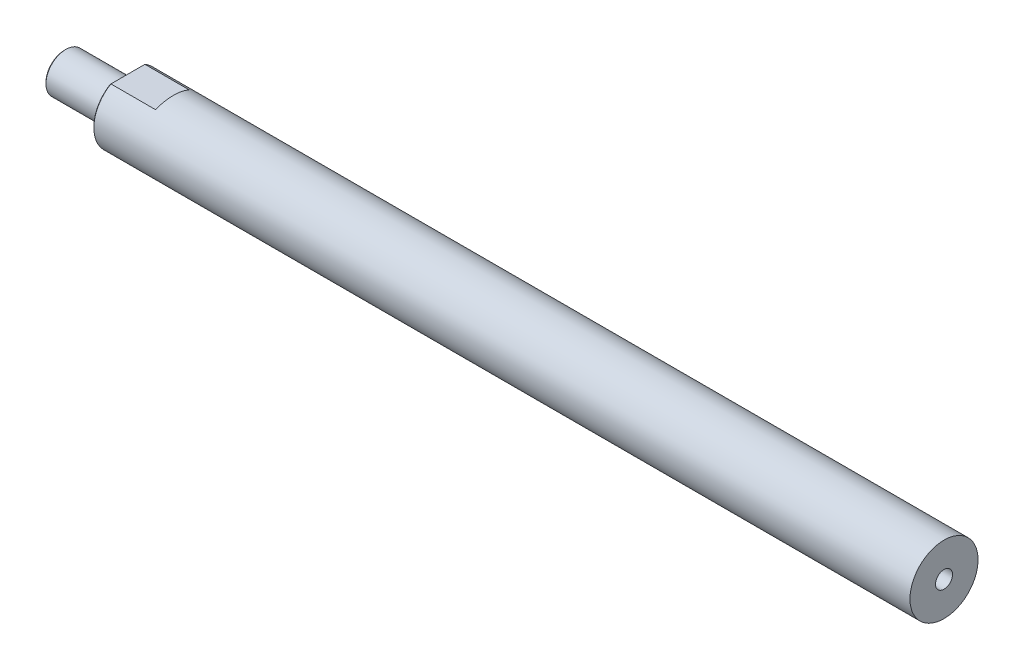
ISO-10303-21;
HEADER;
FILE_DESCRIPTION(('STEP AP214'),'2;1');
FILE_NAME('part.step','',(''),(''),'','','');
FILE_SCHEMA(('AUTOMOTIVE_DESIGN { 1 0 10303 214 1 1 1 1 }'));
ENDSEC;
DATA;
#1=APPLICATION_CONTEXT('core data for automotive mechanical design processes');
#2=APPLICATION_PROTOCOL_DEFINITION('international standard','automotive_design',2000,#1);
#3=PRODUCT_CONTEXT('',#1,'mechanical');
#4=PRODUCT('Part','Part','',(#3));
#5=PRODUCT_RELATED_PRODUCT_CATEGORY('part','',(#4));
#6=PRODUCT_DEFINITION_FORMATION('','',#4);
#7=PRODUCT_DEFINITION_CONTEXT('part definition',#1,'design');
#8=PRODUCT_DEFINITION('design','',#6,#7);
#9=PRODUCT_DEFINITION_SHAPE('','',#8);
#10=(LENGTH_UNIT() NAMED_UNIT(*) SI_UNIT(.MILLI.,.METRE.));
#11=(NAMED_UNIT(*) PLANE_ANGLE_UNIT() SI_UNIT($,.RADIAN.));
#12=(NAMED_UNIT(*) SI_UNIT($,.STERADIAN.) SOLID_ANGLE_UNIT());
#13=UNCERTAINTY_MEASURE_WITH_UNIT(LENGTH_MEASURE(1.E-05),#10,'distance_accuracy_value','');
#14=(GEOMETRIC_REPRESENTATION_CONTEXT(3) GLOBAL_UNCERTAINTY_ASSIGNED_CONTEXT((#13)) GLOBAL_UNIT_ASSIGNED_CONTEXT((#10,
#11,#12)) REPRESENTATION_CONTEXT('',''));
#15=CARTESIAN_POINT('',(0.,0.,0.));
#16=DIRECTION('',(0.,0.,1.));
#17=DIRECTION('',(1.,0.,0.));
#18=AXIS2_PLACEMENT_3D('',#15,#16,#17);
#19=CARTESIAN_POINT('',(-35.0012,0.,0.));
#20=DIRECTION('',(1.,0.,0.));
#21=DIRECTION('',(0.,0.,-1.));
#22=AXIS2_PLACEMENT_3D('',#19,#20,#21);
#23=PLANE('',#22);
#24=CARTESIAN_POINT('',(-35.0012,0.,0.));
#25=DIRECTION('',(1.,0.,0.));
#26=DIRECTION('',(0.,0.,-1.));
#27=AXIS2_PLACEMENT_3D('',#24,#25,#26);
#28=CIRCLE('',#27,10.3505);
#29=CARTESIAN_POINT('',(-35.0012,0.,-10.3505));
#30=VERTEX_POINT('',#29);
#31=EDGE_CURVE('E88',#30,#30,#28,.F.);
#32=ORIENTED_EDGE('',*,*,#31,.T.);
#33=EDGE_LOOP('',(#32));
#34=FACE_BOUND('',#33,.T.);
#35=CARTESIAN_POINT('',(-35.0012,0.,0.));
#36=DIRECTION('',(-1.,0.,0.));
#37=DIRECTION('',(0.,0.,1.));
#38=AXIS2_PLACEMENT_3D('',#35,#36,#37);
#39=CIRCLE('',#38,5.75437);
#40=CARTESIAN_POINT('',(-35.0012,0.,5.75437));
#41=VERTEX_POINT('',#40);
#42=EDGE_CURVE('E98',#41,#41,#39,.T.);
#43=ORIENTED_EDGE('',*,*,#42,.F.);
#44=EDGE_LOOP('',(#43));
#45=FACE_BOUND('',#44,.T.);
#46=ADVANCED_FACE('F36',(#34,#45),#23,.F.);
#47=CARTESIAN_POINT('',(-34.7533783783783,0.,0.));
#48=DIRECTION('',(-1.,0.,0.));
#49=DIRECTION('',(0.,0.,1.));
#50=AXIS2_PLACEMENT_3D('',#47,#48,#49);
#51=CYLINDRICAL_SURFACE('',#50,11.1125);
#52=CARTESIAN_POINT('',(-34.2392,0.,0.));
#53=DIRECTION('',(1.,0.,0.));
#54=DIRECTION('',(0.,0.,-1.));
#55=AXIS2_PLACEMENT_3D('',#52,#53,#54);
#56=CIRCLE('',#55,11.1125);
#57=CARTESIAN_POINT('',(-34.2392,0.,-11.1125));
#58=VERTEX_POINT('',#57);
#59=EDGE_CURVE('E118',#58,#58,#56,.T.);
#60=ORIENTED_EDGE('',*,*,#59,.T.);
#61=EDGE_LOOP('',(#60));
#62=FACE_BOUND('',#61,.T.);
#63=CARTESIAN_POINT('',(-0.761999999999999,0.,0.));
#64=DIRECTION('',(1.,0.,0.));
#65=DIRECTION('',(0.,0.,-1.));
#66=AXIS2_PLACEMENT_3D('',#63,#64,#65);
#67=CIRCLE('',#66,11.1125);
#68=CARTESIAN_POINT('',(-0.761999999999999,0.,-11.1125));
#69=VERTEX_POINT('',#68);
#70=EDGE_CURVE('E107',#69,#69,#67,.F.);
#71=ORIENTED_EDGE('',*,*,#70,.T.);
#72=EDGE_LOOP('',(#71));
#73=FACE_BOUND('',#72,.T.);
#74=ADVANCED_FACE('F147',(#62,#73),#51,.T.);
#75=CARTESIAN_POINT('',(0.,11.1125,0.));
#76=DIRECTION('',(1.,0.,0.));
#77=DIRECTION('',(0.,0.,-1.));
#78=AXIS2_PLACEMENT_3D('',#75,#76,#77);
#79=PLANE('',#78);
#80=CARTESIAN_POINT('',(0.,0.,0.));
#81=DIRECTION('',(1.,0.,0.));
#82=DIRECTION('',(0.,0.,-1.));
#83=AXIS2_PLACEMENT_3D('',#80,#81,#82);
#84=CIRCLE('',#83,18.5419999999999);
#85=CARTESIAN_POINT('',(0.,16.0019999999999,-9.36705716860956));
#86=VERTEX_POINT('',#85);
#87=CARTESIAN_POINT('',(0.,16.0019999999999,9.36705716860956));
#88=VERTEX_POINT('',#87);
#89=EDGE_CURVE('E121',#86,#88,#84,.F.);
#90=ORIENTED_EDGE('',*,*,#89,.T.);
#91=DIRECTION('',(0.,0.,-1.));
#92=VECTOR('',#91,1.);
#93=CARTESIAN_POINT('',(0.,16.0019999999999,0.));
#94=LINE('',#93,#92);
#95=EDGE_CURVE('E123',#88,#86,#94,.T.);
#96=ORIENTED_EDGE('',*,*,#95,.T.);
#97=EDGE_LOOP('',(#90,#96));
#98=FACE_BOUND('',#97,.T.);
#99=CARTESIAN_POINT('',(0.,0.,0.));
#100=DIRECTION('',(1.,0.,0.));
#101=DIRECTION('',(0.,0.,-1.));
#102=AXIS2_PLACEMENT_3D('',#99,#100,#101);
#103=CIRCLE('',#102,11.8745);
#104=CARTESIAN_POINT('',(0.,0.,-11.8745));
#105=VERTEX_POINT('',#104);
#106=EDGE_CURVE('E110',#105,#105,#103,.T.);
#107=ORIENTED_EDGE('',*,*,#106,.T.);
#108=EDGE_LOOP('',(#107));
#109=FACE_BOUND('',#108,.T.);
#110=ADVANCED_FACE('F151',(#98,#109),#79,.F.);
#111=CARTESIAN_POINT('',(-34.7533783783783,0.,0.));
#112=DIRECTION('',(-1.,0.,0.));
#113=DIRECTION('',(0.,0.,1.));
#114=AXIS2_PLACEMENT_3D('',#111,#112,#113);
#115=CYLINDRICAL_SURFACE('',#114,19.05);
#116=DIRECTION('',(-1.,0.,0.));
#117=VECTOR('',#116,1.);
#118=CARTESIAN_POINT('',(-34.7533783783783,16.51,9.50380976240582));
#119=LINE('',#118,#117);
#120=CARTESIAN_POINT('',(25.4,16.51,9.50380976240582));
#121=VERTEX_POINT('',#120);
#122=CARTESIAN_POINT('',(0.508000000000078,16.51,9.50380976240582));
#123=VERTEX_POINT('',#122);
#124=EDGE_CURVE('E78',#121,#123,#119,.T.);
#125=ORIENTED_EDGE('',*,*,#124,.T.);
#126=CARTESIAN_POINT('',(0.508000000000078,0.,0.));
#127=DIRECTION('',(1.,0.,0.));
#128=DIRECTION('',(0.,0.,-1.));
#129=AXIS2_PLACEMENT_3D('',#126,#127,#128);
#130=CIRCLE('',#129,19.05);
#131=CARTESIAN_POINT('',(0.508000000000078,16.51,-9.50380976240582));
#132=VERTEX_POINT('',#131);
#133=EDGE_CURVE('E11',#123,#132,#130,.T.);
#134=ORIENTED_EDGE('',*,*,#133,.T.);
#135=DIRECTION('',(-1.,0.,0.));
#136=VECTOR('',#135,1.);
#137=CARTESIAN_POINT('',(-34.7533783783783,16.51,-9.50380976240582));
#138=LINE('',#137,#136);
#139=CARTESIAN_POINT('',(25.4,16.51,-9.50380976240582));
#140=VERTEX_POINT('',#139);
#141=EDGE_CURVE('E79',#132,#140,#138,.F.);
#142=ORIENTED_EDGE('',*,*,#141,.T.);
#143=CARTESIAN_POINT('',(20.9761588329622,0.,0.));
#144=DIRECTION('',(0.965925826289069,-0.258819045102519,0.));
#145=DIRECTION('',(-0.258819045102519,-0.965925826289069,0.));
#146=AXIS2_PLACEMENT_3D('',#143,#144,#145);
#147=ELLIPSE('',#146,19.7220112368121,19.05);
#148=EDGE_CURVE('E74',#140,#121,#147,.T.);
#149=ORIENTED_EDGE('',*,*,#148,.T.);
#150=EDGE_LOOP('',(#125,#134,#142,#149));
#151=FACE_BOUND('',#150,.T.);
#152=CARTESIAN_POINT('',(457.2,0.,0.));
#153=DIRECTION('',(-1.,0.,0.));
#154=DIRECTION('',(0.,0.,1.));
#155=AXIS2_PLACEMENT_3D('',#152,#153,#154);
#156=CIRCLE('',#155,19.05);
#157=CARTESIAN_POINT('',(457.2,0.,19.05));
#158=VERTEX_POINT('',#157);
#159=EDGE_CURVE('E104',#158,#158,#156,.T.);
#160=ORIENTED_EDGE('',*,*,#159,.T.);
#161=EDGE_LOOP('',(#160));
#162=FACE_BOUND('',#161,.T.);
#163=ADVANCED_FACE('F76',(#151,#162),#115,.T.);
#164=CARTESIAN_POINT('',(457.2,19.05,0.));
#165=DIRECTION('',(-1.,0.,0.));
#166=DIRECTION('',(0.,0.,1.));
#167=AXIS2_PLACEMENT_3D('',#164,#165,#166);
#168=PLANE('',#167);
#169=CARTESIAN_POINT('',(457.2,0.,0.));
#170=DIRECTION('',(1.,0.,0.));
#171=DIRECTION('',(0.,0.,-1.));
#172=AXIS2_PLACEMENT_3D('',#169,#170,#171);
#173=CIRCLE('',#172,4.7625);
#174=CARTESIAN_POINT('',(457.2,0.,-4.7625));
#175=VERTEX_POINT('',#174);
#176=EDGE_CURVE('E91',#175,#175,#173,.T.);
#177=ORIENTED_EDGE('',*,*,#176,.F.);
#178=EDGE_LOOP('',(#177));
#179=FACE_BOUND('',#178,.T.);
#180=ORIENTED_EDGE('',*,*,#159,.F.);
#181=EDGE_LOOP('',(#180));
#182=FACE_BOUND('',#181,.T.);
#183=ADVANCED_FACE('F158',(#179,#182),#168,.F.);
#184=CARTESIAN_POINT('',(-12.6492,0.,0.));
#185=DIRECTION('',(-1.,0.,0.));
#186=DIRECTION('',(0.,0.,1.));
#187=AXIS2_PLACEMENT_3D('',#184,#185,#186);
#188=CONICAL_SURFACE('',#187,5.75436999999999,1.02974425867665);
#189=CARTESIAN_POINT('',(-12.0532243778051,0.,0.));
#190=DIRECTION('',(-1.,0.,0.));
#191=DIRECTION('',(0.,0.,1.));
#192=AXIS2_PLACEMENT_3D('',#189,#190,#191);
#193=CIRCLE('',#192,4.7625);
#194=CARTESIAN_POINT('',(-12.0532243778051,0.,4.7625));
#195=VERTEX_POINT('',#194);
#196=EDGE_CURVE('E94',#195,#195,#193,.F.);
#197=ORIENTED_EDGE('',*,*,#196,.T.);
#198=EDGE_LOOP('',(#197));
#199=FACE_BOUND('',#198,.T.);
#200=CARTESIAN_POINT('',(-12.6492,0.,0.));
#201=DIRECTION('',(-1.,0.,0.));
#202=DIRECTION('',(0.,0.,1.));
#203=AXIS2_PLACEMENT_3D('',#200,#201,#202);
#204=CIRCLE('',#203,5.75436999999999);
#205=CARTESIAN_POINT('',(-12.6492,0.,5.75436999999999));
#206=VERTEX_POINT('',#205);
#207=EDGE_CURVE('E101',#206,#206,#204,.T.);
#208=ORIENTED_EDGE('',*,*,#207,.T.);
#209=EDGE_LOOP('',(#208));
#210=FACE_BOUND('',#209,.T.);
#211=ADVANCED_FACE('F161',(#199,#210),#188,.F.);
#212=CARTESIAN_POINT('',(-35.0012,0.,0.));
#213=DIRECTION('',(-1.,0.,0.));
#214=DIRECTION('',(0.,0.,1.));
#215=AXIS2_PLACEMENT_3D('',#212,#213,#214);
#216=CYLINDRICAL_SURFACE('',#215,5.75437);
#217=ORIENTED_EDGE('',*,*,#207,.F.);
#218=EDGE_LOOP('',(#217));
#219=FACE_BOUND('',#218,.T.);
#220=ORIENTED_EDGE('',*,*,#42,.T.);
#221=EDGE_LOOP('',(#220));
#222=FACE_BOUND('',#221,.T.);
#223=ADVANCED_FACE('F143',(#219,#222),#216,.F.);
#224=CARTESIAN_POINT('',(-0.761999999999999,0.,0.));
#225=DIRECTION('',(1.,0.,0.));
#226=DIRECTION('',(0.,0.,-1.));
#227=AXIS2_PLACEMENT_3D('',#224,#225,#226);
#228=TOROIDAL_SURFACE('',#227,11.8745,0.762);
#229=ORIENTED_EDGE('',*,*,#106,.F.);
#230=EDGE_LOOP('',(#229));
#231=FACE_BOUND('',#230,.T.);
#232=ORIENTED_EDGE('',*,*,#70,.F.);
#233=EDGE_LOOP('',(#232));
#234=FACE_BOUND('',#233,.T.);
#235=ADVANCED_FACE('F139',(#231,#234),#228,.F.);
#236=CARTESIAN_POINT('',(-35.0012,0.,0.));
#237=DIRECTION('',(1.,0.,0.));
#238=DIRECTION('',(0.,0.,-1.));
#239=AXIS2_PLACEMENT_3D('',#236,#237,#238);
#240=CYLINDRICAL_SURFACE('',#239,4.7625);
#241=ORIENTED_EDGE('',*,*,#176,.T.);
#242=EDGE_LOOP('',(#241));
#243=FACE_BOUND('',#242,.T.);
#244=ORIENTED_EDGE('',*,*,#196,.F.);
#245=EDGE_LOOP('',(#244));
#246=FACE_BOUND('',#245,.T.);
#247=ADVANCED_FACE('F142',(#243,#246),#240,.F.);
#248=CARTESIAN_POINT('',(25.4,16.51,-19.05));
#249=DIRECTION('',(0.965925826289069,-0.258819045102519,0.));
#250=DIRECTION('',(0.258819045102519,0.965925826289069,0.));
#251=AXIS2_PLACEMENT_3D('',#248,#249,#250);
#252=PLANE('',#251);
#253=DIRECTION('',(0.,0.,1.));
#254=VECTOR('',#253,1.);
#255=CARTESIAN_POINT('',(25.4,16.51,-19.05));
#256=LINE('',#255,#254);
#257=EDGE_CURVE('E87',#140,#121,#256,.T.);
#258=ORIENTED_EDGE('',*,*,#257,.T.);
#259=ORIENTED_EDGE('',*,*,#148,.F.);
#260=EDGE_LOOP('',(#258,#259));
#261=FACE_BOUND('',#260,.T.);
#262=ADVANCED_FACE('F90',(#261),#252,.F.);
#263=CARTESIAN_POINT('',(-1.016,16.51,-19.05));
#264=DIRECTION('',(0.,-1.,0.));
#265=DIRECTION('',(0.,0.,-1.));
#266=AXIS2_PLACEMENT_3D('',#263,#264,#265);
#267=PLANE('',#266);
#268=ORIENTED_EDGE('',*,*,#141,.F.);
#269=DIRECTION('',(0.,0.,1.));
#270=VECTOR('',#269,1.);
#271=CARTESIAN_POINT('',(0.508000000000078,16.51,-19.05));
#272=LINE('',#271,#270);
#273=EDGE_CURVE('E49',#132,#123,#272,.T.);
#274=ORIENTED_EDGE('',*,*,#273,.T.);
#275=ORIENTED_EDGE('',*,*,#124,.F.);
#276=ORIENTED_EDGE('',*,*,#257,.F.);
#277=EDGE_LOOP('',(#268,#274,#275,#276));
#278=FACE_BOUND('',#277,.T.);
#279=ADVANCED_FACE('F86',(#278),#267,.F.);
#280=CARTESIAN_POINT('',(-35.0012,0.,0.));
#281=DIRECTION('',(1.,0.,0.));
#282=DIRECTION('',(0.,0.,-1.));
#283=AXIS2_PLACEMENT_3D('',#280,#281,#282);
#284=CONICAL_SURFACE('',#283,10.3505,0.785398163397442);
#285=ORIENTED_EDGE('',*,*,#59,.F.);
#286=EDGE_LOOP('',(#285));
#287=FACE_BOUND('',#286,.T.);
#288=ORIENTED_EDGE('',*,*,#31,.F.);
#289=EDGE_LOOP('',(#288));
#290=FACE_BOUND('',#289,.T.);
#291=ADVANCED_FACE('F133',(#287,#290),#284,.T.);
#292=CARTESIAN_POINT('',(0.,0.,0.));
#293=DIRECTION('',(1.,0.,0.));
#294=DIRECTION('',(0.,0.,-1.));
#295=AXIS2_PLACEMENT_3D('',#292,#293,#294);
#296=CONICAL_SURFACE('',#295,18.5419999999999,0.785398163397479);
#297=CARTESIAN_POINT('',(0.,16.0019999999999,-9.36705716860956));
#298=CARTESIAN_POINT('',(0.0846452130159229,16.0866452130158,-9.39000866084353));
#299=CARTESIAN_POINT('',(0.16930115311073,16.1713011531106,-9.41288045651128));
#300=CARTESIAN_POINT('',(0.338634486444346,16.3406344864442,-9.45846465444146));
#301=CARTESIAN_POINT('',(0.423311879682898,16.4253118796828,-9.4811770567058));
#302=CARTESIAN_POINT('',(0.508000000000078,16.51,-9.50380976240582));
#303=B_SPLINE_CURVE_WITH_KNOTS('',3,(#297,#298,#299,#300,#301,#302),.UNSPECIFIED.,.F.,.F.,(4,2,
4),(0.,0.365660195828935,0.731320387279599),.UNSPECIFIED.);
#304=EDGE_CURVE('E96',#132,#86,#303,.F.);
#305=ORIENTED_EDGE('',*,*,#304,.F.);
#306=ORIENTED_EDGE('',*,*,#133,.F.);
#307=CARTESIAN_POINT('',(0.508000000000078,16.51,9.50380976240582));
#308=CARTESIAN_POINT('',(0.423311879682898,16.4253118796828,9.4811770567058));
#309=CARTESIAN_POINT('',(0.338634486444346,16.3406344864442,9.45846465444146));
#310=CARTESIAN_POINT('',(0.169301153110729,16.1713011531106,9.41288045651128));
#311=CARTESIAN_POINT('',(0.0846452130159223,16.0866452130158,9.39000866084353));
#312=CARTESIAN_POINT('',(0.,16.0019999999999,9.36705716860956));
#313=B_SPLINE_CURVE_WITH_KNOTS('',3,(#307,#308,#309,#310,#311,#312),.UNSPECIFIED.,.F.,.F.,(4,2,
4),(0.,0.365660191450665,0.7313203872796),.UNSPECIFIED.);
#314=EDGE_CURVE('E41',#88,#123,#313,.F.);
#315=ORIENTED_EDGE('',*,*,#314,.F.);
#316=ORIENTED_EDGE('',*,*,#89,.F.);
#317=EDGE_LOOP('',(#305,#306,#315,#316));
#318=FACE_BOUND('',#317,.T.);
#319=ADVANCED_FACE('F129',(#318),#296,.T.);
#320=CARTESIAN_POINT('',(0.,16.0019999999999,0.));
#321=DIRECTION('',(0.707106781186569,-0.707106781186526,0.));
#322=DIRECTION('',(0.,0.,-1.));
#323=AXIS2_PLACEMENT_3D('',#320,#321,#322);
#324=PLANE('',#323);
#325=ORIENTED_EDGE('',*,*,#314,.T.);
#326=ORIENTED_EDGE('',*,*,#273,.F.);
#327=ORIENTED_EDGE('',*,*,#304,.T.);
#328=ORIENTED_EDGE('',*,*,#95,.F.);
#329=EDGE_LOOP('',(#325,#326,#327,#328));
#330=FACE_BOUND('',#329,.T.);
#331=ADVANCED_FACE('F38',(#330),#324,.F.);
#332=CLOSED_SHELL('',(#46,#74,#110,#163,#183,#211,#223,#235,#247,#262,#279,#291,#319,#331));
#333=MANIFOLD_SOLID_BREP('B2',#332);
#334=ADVANCED_BREP_SHAPE_REPRESENTATION('',(#18,#333),#14);
#335=SHAPE_DEFINITION_REPRESENTATION(#9,#334);
ENDSEC;
END-ISO-10303-21;
